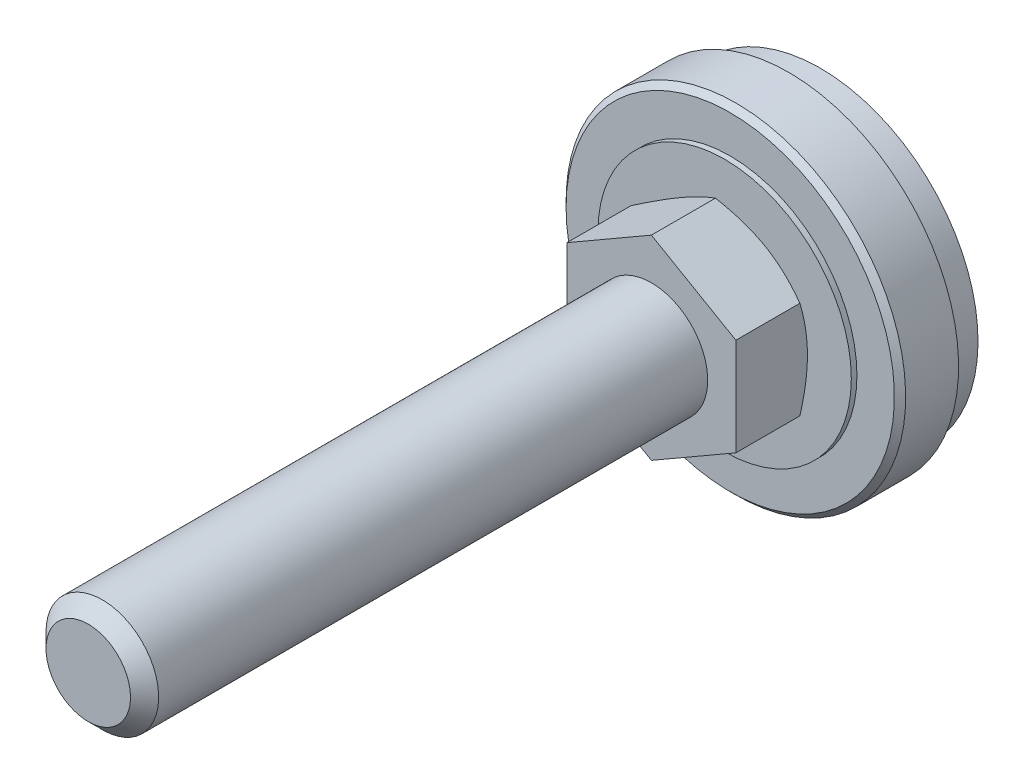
ISO-10303-21;
HEADER;
FILE_DESCRIPTION(('STEP AP214'),'2;1');
FILE_NAME('part.step','',(''),(''),'','','');
FILE_SCHEMA(('AUTOMOTIVE_DESIGN { 1 0 10303 214 1 1 1 1 }'));
ENDSEC;
DATA;
#1=APPLICATION_CONTEXT('core data for automotive mechanical design processes');
#2=APPLICATION_PROTOCOL_DEFINITION('international standard','automotive_design',2000,#1);
#3=PRODUCT_CONTEXT('',#1,'mechanical');
#4=PRODUCT('Part','Part','',(#3));
#5=PRODUCT_RELATED_PRODUCT_CATEGORY('part','',(#4));
#6=PRODUCT_DEFINITION_FORMATION('','',#4);
#7=PRODUCT_DEFINITION_CONTEXT('part definition',#1,'design');
#8=PRODUCT_DEFINITION('design','',#6,#7);
#9=PRODUCT_DEFINITION_SHAPE('','',#8);
#10=(LENGTH_UNIT() NAMED_UNIT(*) SI_UNIT(.MILLI.,.METRE.));
#11=(NAMED_UNIT(*) PLANE_ANGLE_UNIT() SI_UNIT($,.RADIAN.));
#12=(NAMED_UNIT(*) SI_UNIT($,.STERADIAN.) SOLID_ANGLE_UNIT());
#13=UNCERTAINTY_MEASURE_WITH_UNIT(LENGTH_MEASURE(1.E-05),#10,'distance_accuracy_value','');
#14=(GEOMETRIC_REPRESENTATION_CONTEXT(3) GLOBAL_UNCERTAINTY_ASSIGNED_CONTEXT((#13)) GLOBAL_UNIT_ASSIGNED_CONTEXT((#10,
#11,#12)) REPRESENTATION_CONTEXT('',''));
#15=CARTESIAN_POINT('',(0.,0.,0.));
#16=DIRECTION('',(0.,0.,1.));
#17=DIRECTION('',(1.,0.,0.));
#18=AXIS2_PLACEMENT_3D('',#15,#16,#17);
#19=CARTESIAN_POINT('',(0.,0.,30.));
#20=DIRECTION('',(0.,0.,1.));
#21=DIRECTION('',(0.5,-0.866025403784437,0.));
#22=AXIS2_PLACEMENT_3D('',#19,#20,#21);
#23=PLANE('',#22);
#24=DIRECTION('',(0.,1.,0.));
#25=VECTOR('',#24,1.);
#26=CARTESIAN_POINT('',(15.,-8.66025403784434,30.));
#27=LINE('',#26,#25);
#28=CARTESIAN_POINT('',(15.,-8.66025403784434,30.));
#29=VERTEX_POINT('',#28);
#30=CARTESIAN_POINT('',(15.,8.66025403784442,30.));
#31=VERTEX_POINT('',#30);
#32=EDGE_CURVE('E226',#29,#31,#27,.T.);
#33=ORIENTED_EDGE('',*,*,#32,.T.);
#34=DIRECTION('',(-0.86602540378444,0.5,0.));
#35=VECTOR('',#34,1.);
#36=CARTESIAN_POINT('',(15.,8.66025403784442,30.));
#37=LINE('',#36,#35);
#38=CARTESIAN_POINT('',(0.,17.3205080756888,30.));
#39=VERTEX_POINT('',#38);
#40=EDGE_CURVE('E373',#31,#39,#37,.T.);
#41=ORIENTED_EDGE('',*,*,#40,.T.);
#42=DIRECTION('',(-0.866025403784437,-0.5,0.));
#43=VECTOR('',#42,1.);
#44=CARTESIAN_POINT('',(0.,17.3205080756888,30.));
#45=LINE('',#44,#43);
#46=CARTESIAN_POINT('',(-15.,8.66025403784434,30.));
#47=VERTEX_POINT('',#46);
#48=EDGE_CURVE('E372',#39,#47,#45,.T.);
#49=ORIENTED_EDGE('',*,*,#48,.T.);
#50=DIRECTION('',(0.,-1.,0.));
#51=VECTOR('',#50,1.);
#52=CARTESIAN_POINT('',(-15.,8.66025403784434,30.));
#53=LINE('',#52,#51);
#54=CARTESIAN_POINT('',(-15.,-8.66025403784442,30.));
#55=VERTEX_POINT('',#54);
#56=EDGE_CURVE('E377',#47,#55,#53,.T.);
#57=ORIENTED_EDGE('',*,*,#56,.T.);
#58=DIRECTION('',(0.86602540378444,-0.5,0.));
#59=VECTOR('',#58,1.);
#60=CARTESIAN_POINT('',(-15.,-8.66025403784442,30.));
#61=LINE('',#60,#59);
#62=CARTESIAN_POINT('',(0.,-17.3205080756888,30.));
#63=VERTEX_POINT('',#62);
#64=EDGE_CURVE('E379',#55,#63,#61,.T.);
#65=ORIENTED_EDGE('',*,*,#64,.T.);
#66=DIRECTION('',(0.866025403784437,0.5,0.));
#67=VECTOR('',#66,1.);
#68=CARTESIAN_POINT('',(0.,-17.3205080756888,30.));
#69=LINE('',#68,#67);
#70=EDGE_CURVE('E37',#63,#29,#69,.T.);
#71=ORIENTED_EDGE('',*,*,#70,.T.);
#72=EDGE_LOOP('',(#33,#41,#49,#57,#65,#71));
#73=FACE_BOUND('',#72,.T.);
#74=CARTESIAN_POINT('',(0.,0.,30.));
#75=DIRECTION('',(0.,0.,1.));
#76=DIRECTION('',(0.5,-0.866025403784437,0.));
#77=AXIS2_PLACEMENT_3D('',#74,#75,#76);
#78=CIRCLE('',#77,10.);
#79=CARTESIAN_POINT('',(5.,-8.66025403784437,30.));
#80=VERTEX_POINT('',#79);
#81=EDGE_CURVE('E230',#80,#80,#78,.T.);
#82=ORIENTED_EDGE('',*,*,#81,.F.);
#83=EDGE_LOOP('',(#82));
#84=FACE_BOUND('',#83,.T.);
#85=ADVANCED_FACE('F14',(#73,#84),#23,.T.);
#86=CARTESIAN_POINT('',(-11.25,19.4855715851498,17.));
#87=DIRECTION('',(0.,0.,1.));
#88=DIRECTION('',(0.5,-0.866025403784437,0.));
#89=AXIS2_PLACEMENT_3D('',#86,#87,#88);
#90=PLANE('',#89);
#91=CARTESIAN_POINT('',(0.,0.,17.));
#92=DIRECTION('',(0.,0.,1.));
#93=DIRECTION('',(0.5,-0.866025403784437,0.));
#94=AXIS2_PLACEMENT_3D('',#91,#92,#93);
#95=CIRCLE('',#94,22.5);
#96=CARTESIAN_POINT('',(11.25,-19.4855715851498,17.));
#97=VERTEX_POINT('',#96);
#98=EDGE_CURVE('E102',#97,#97,#95,.T.);
#99=ORIENTED_EDGE('',*,*,#98,.T.);
#100=EDGE_LOOP('',(#99));
#101=FACE_BOUND('',#100,.T.);
#102=CARTESIAN_POINT('',(0.,0.,17.));
#103=DIRECTION('',(0.,0.,-1.));
#104=DIRECTION('',(-0.5,0.866025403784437,0.));
#105=AXIS2_PLACEMENT_3D('',#102,#103,#104);
#106=CIRCLE('',#105,14.5);
#107=CARTESIAN_POINT('',(-7.25,12.5573683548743,17.));
#108=VERTEX_POINT('',#107);
#109=EDGE_CURVE('E84',#108,#108,#106,.T.);
#110=ORIENTED_EDGE('',*,*,#109,.T.);
#111=EDGE_LOOP('',(#110));
#112=FACE_BOUND('',#111,.T.);
#113=ADVANCED_FACE('F186',(#101,#112),#90,.T.);
#114=CARTESIAN_POINT('',(0.,0.,0.));
#115=DIRECTION('',(0.,0.,-1.));
#116=DIRECTION('',(-0.5,0.866025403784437,0.));
#117=AXIS2_PLACEMENT_3D('',#114,#115,#116);
#118=PLANE('',#117);
#119=CARTESIAN_POINT('',(0.,0.,0.));
#120=DIRECTION('',(0.,0.,1.));
#121=DIRECTION('',(0.5,-0.866025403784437,0.));
#122=AXIS2_PLACEMENT_3D('',#119,#120,#121);
#123=CIRCLE('',#122,28.);
#124=CARTESIAN_POINT('',(14.,-24.2487113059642,0.));
#125=VERTEX_POINT('',#124);
#126=EDGE_CURVE('E73',#125,#125,#123,.T.);
#127=ORIENTED_EDGE('',*,*,#126,.F.);
#128=EDGE_LOOP('',(#127));
#129=FACE_BOUND('',#128,.T.);
#130=ADVANCED_FACE('F189',(#129),#118,.T.);
#131=CARTESIAN_POINT('',(0.,0.,134.742297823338));
#132=DIRECTION('',(0.,0.,1.));
#133=DIRECTION('',(0.5,-0.866025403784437,0.));
#134=AXIS2_PLACEMENT_3D('',#131,#132,#133);
#135=CYLINDRICAL_SURFACE('',#134,28.);
#136=ORIENTED_EDGE('',*,*,#126,.T.);
#137=EDGE_LOOP('',(#136));
#138=FACE_BOUND('',#137,.T.);
#139=CARTESIAN_POINT('',(0.,0.,5.6));
#140=DIRECTION('',(0.,0.,1.));
#141=DIRECTION('',(0.5,-0.866025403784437,0.));
#142=AXIS2_PLACEMENT_3D('',#139,#140,#141);
#143=CIRCLE('',#142,28.);
#144=CARTESIAN_POINT('',(14.,-24.2487113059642,5.6));
#145=VERTEX_POINT('',#144);
#146=EDGE_CURVE('E117',#145,#145,#143,.T.);
#147=ORIENTED_EDGE('',*,*,#146,.F.);
#148=EDGE_LOOP('',(#147));
#149=FACE_BOUND('',#148,.T.);
#150=ADVANCED_FACE('F209',(#138,#149),#135,.T.);
#151=CARTESIAN_POINT('',(-15.075,26.1106659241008,5.6));
#152=DIRECTION('',(0.,0.,-1.));
#153=DIRECTION('',(-0.5,0.866025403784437,0.));
#154=AXIS2_PLACEMENT_3D('',#151,#152,#153);
#155=PLANE('',#154);
#156=ORIENTED_EDGE('',*,*,#146,.T.);
#157=EDGE_LOOP('',(#156));
#158=FACE_BOUND('',#157,.T.);
#159=CARTESIAN_POINT('',(0.,0.,5.6));
#160=DIRECTION('',(0.,0.,1.));
#161=DIRECTION('',(0.5,-0.866025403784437,0.));
#162=AXIS2_PLACEMENT_3D('',#159,#160,#161);
#163=CIRCLE('',#162,30.15);
#164=CARTESIAN_POINT('',(15.075,-26.1106659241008,5.6));
#165=VERTEX_POINT('',#164);
#166=EDGE_CURVE('E114',#165,#165,#163,.T.);
#167=ORIENTED_EDGE('',*,*,#166,.F.);
#168=EDGE_LOOP('',(#167));
#169=FACE_BOUND('',#168,.T.);
#170=ADVANCED_FACE('F205',(#158,#169),#155,.T.);
#171=CARTESIAN_POINT('',(0.,0.,134.742297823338));
#172=DIRECTION('',(0.,0.,1.));
#173=DIRECTION('',(0.5,-0.866025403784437,0.));
#174=AXIS2_PLACEMENT_3D('',#171,#172,#173);
#175=CYLINDRICAL_SURFACE('',#174,30.15);
#176=ORIENTED_EDGE('',*,*,#166,.T.);
#177=EDGE_LOOP('',(#176));
#178=FACE_BOUND('',#177,.T.);
#179=CARTESIAN_POINT('',(0.,0.,15.));
#180=DIRECTION('',(0.,0.,1.));
#181=DIRECTION('',(0.5,-0.866025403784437,0.));
#182=AXIS2_PLACEMENT_3D('',#179,#180,#181);
#183=CIRCLE('',#182,30.15);
#184=CARTESIAN_POINT('',(15.075,-26.1106659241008,15.));
#185=VERTEX_POINT('',#184);
#186=EDGE_CURVE('E111',#185,#185,#183,.T.);
#187=ORIENTED_EDGE('',*,*,#186,.F.);
#188=EDGE_LOOP('',(#187));
#189=FACE_BOUND('',#188,.T.);
#190=ADVANCED_FACE('F201',(#178,#189),#175,.T.);
#191=CARTESIAN_POINT('',(0.,0.,16.));
#192=DIRECTION('',(0.,0.,-1.));
#193=DIRECTION('',(-0.5,0.866025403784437,0.));
#194=AXIS2_PLACEMENT_3D('',#191,#192,#193);
#195=CONICAL_SURFACE('',#194,29.15,0.785398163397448);
#196=ORIENTED_EDGE('',*,*,#186,.T.);
#197=EDGE_LOOP('',(#196));
#198=FACE_BOUND('',#197,.T.);
#199=CARTESIAN_POINT('',(0.,0.,16.));
#200=DIRECTION('',(0.,0.,1.));
#201=DIRECTION('',(0.5,-0.866025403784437,0.));
#202=AXIS2_PLACEMENT_3D('',#199,#200,#201);
#203=CIRCLE('',#202,29.15);
#204=CARTESIAN_POINT('',(14.575,-25.2446405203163,16.));
#205=VERTEX_POINT('',#204);
#206=EDGE_CURVE('E108',#205,#205,#203,.T.);
#207=ORIENTED_EDGE('',*,*,#206,.F.);
#208=EDGE_LOOP('',(#207));
#209=FACE_BOUND('',#208,.T.);
#210=ADVANCED_FACE('F197',(#198,#209),#195,.T.);
#211=CARTESIAN_POINT('',(-14.575,25.2446405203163,16.));
#212=DIRECTION('',(0.,0.,1.));
#213=DIRECTION('',(0.5,-0.866025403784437,0.));
#214=AXIS2_PLACEMENT_3D('',#211,#212,#213);
#215=PLANE('',#214);
#216=ORIENTED_EDGE('',*,*,#206,.T.);
#217=EDGE_LOOP('',(#216));
#218=FACE_BOUND('',#217,.T.);
#219=CARTESIAN_POINT('',(0.,0.,16.));
#220=DIRECTION('',(0.,0.,1.));
#221=DIRECTION('',(0.5,-0.866025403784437,0.));
#222=AXIS2_PLACEMENT_3D('',#219,#220,#221);
#223=CIRCLE('',#222,22.5);
#224=CARTESIAN_POINT('',(11.25,-19.4855715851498,16.));
#225=VERTEX_POINT('',#224);
#226=EDGE_CURVE('E105',#225,#225,#223,.T.);
#227=ORIENTED_EDGE('',*,*,#226,.F.);
#228=EDGE_LOOP('',(#227));
#229=FACE_BOUND('',#228,.T.);
#230=ADVANCED_FACE('F193',(#218,#229),#215,.T.);
#231=CARTESIAN_POINT('',(0.,0.,134.742297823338));
#232=DIRECTION('',(0.,0.,1.));
#233=DIRECTION('',(0.5,-0.866025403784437,0.));
#234=AXIS2_PLACEMENT_3D('',#231,#232,#233);
#235=CYLINDRICAL_SURFACE('',#234,22.5);
#236=ORIENTED_EDGE('',*,*,#226,.T.);
#237=EDGE_LOOP('',(#236));
#238=FACE_BOUND('',#237,.T.);
#239=ORIENTED_EDGE('',*,*,#98,.F.);
#240=EDGE_LOOP('',(#239));
#241=FACE_BOUND('',#240,.T.);
#242=ADVANCED_FACE('F133',(#238,#241),#235,.T.);
#243=CARTESIAN_POINT('',(0.,0.,22.4252428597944));
#244=DIRECTION('',(0.,0.,1.));
#245=DIRECTION('',(0.5,-0.866025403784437,0.));
#246=AXIS2_PLACEMENT_3D('',#243,#244,#245);
#247=CONICAL_SURFACE('',#246,23.8967962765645,1.0471975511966);
#248=ORIENTED_EDGE('',*,*,#109,.F.);
#249=EDGE_LOOP('',(#248));
#250=FACE_BOUND('',#249,.T.);
#251=CARTESIAN_POINT('',(-12.8156002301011,-24.7195983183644,24.7042637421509));
#252=CARTESIAN_POINT('',(-12.531199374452,-24.5553994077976,24.5445303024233));
#253=CARTESIAN_POINT('',(-12.2464693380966,-24.3910104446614,24.3855786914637));
#254=CARTESIAN_POINT('',(-11.6762822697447,-24.0618127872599,24.0694158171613));
#255=CARTESIAN_POINT('',(-11.3908252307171,-23.8970040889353,23.9122045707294));
#256=CARTESIAN_POINT('',(-10.5331869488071,-23.4018463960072,23.443406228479));
#257=CARTESIAN_POINT('',(-9.95982008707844,-23.0708128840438,23.1347004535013));
#258=CARTESIAN_POINT('',(-8.80626593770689,-22.4048080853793,22.5251819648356));
#259=CARTESIAN_POINT('',(-8.22605861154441,-22.0698252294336,22.2244196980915));
#260=CARTESIAN_POINT('',(-7.06108881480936,-21.3972296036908,21.6349394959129));
#261=CARTESIAN_POINT('',(-6.47632655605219,-21.0596169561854,21.3462210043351));
#262=CARTESIAN_POINT('',(-5.28180185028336,-20.3699577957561,20.7746714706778));
#263=CARTESIAN_POINT('',(-4.67185404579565,-20.0178042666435,20.49235431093));
#264=CARTESIAN_POINT('',(-3.44488115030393,-19.309411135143,19.9486150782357));
#265=CARTESIAN_POINT('',(-2.82785528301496,-18.9531710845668,19.6871953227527));
#266=CARTESIAN_POINT('',(-1.58686537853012,-18.2366852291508,19.1919746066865));
#267=CARTESIAN_POINT('',(-0.96291770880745,-17.8764488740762,18.9581193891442));
#268=CARTESIAN_POINT('',(0.293985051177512,-17.1507757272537,18.5253878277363));
#269=CARTESIAN_POINT('',(0.926937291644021,-16.7853405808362,18.3265006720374));
#270=CARTESIAN_POINT('',(1.88148437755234,-16.2342325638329,18.0620414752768));
#271=CARTESIAN_POINT('',(2.19961844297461,-16.0505577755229,17.9797180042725));
#272=CARTESIAN_POINT('',(2.83809132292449,-15.6819352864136,17.8273230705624));
#273=CARTESIAN_POINT('',(3.15843009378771,-15.4969876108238,17.757251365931));
#274=CARTESIAN_POINT('',(3.80110433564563,-15.1259394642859,17.6305843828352));
#275=CARTESIAN_POINT('',(4.12343977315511,-14.9398390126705,17.5739888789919));
#276=CARTESIAN_POINT('',(4.76977798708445,-14.5666754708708,17.4753959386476));
#277=CARTESIAN_POINT('',(5.09378068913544,-14.3796124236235,17.4333978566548));
#278=CARTESIAN_POINT('',(5.73869803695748,-14.0072692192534,17.3653714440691));
#279=CARTESIAN_POINT('',(6.05959634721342,-13.8219984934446,17.3391378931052));
#280=CARTESIAN_POINT('',(6.70206615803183,-13.4510683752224,17.3023738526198));
#281=CARTESIAN_POINT('',(7.02363764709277,-13.2654089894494,17.2918430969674));
#282=CARTESIAN_POINT('',(7.66687876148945,-12.8940335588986,17.2867359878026));
#283=CARTESIAN_POINT('',(7.98854838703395,-12.7083175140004,17.2921596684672));
#284=CARTESIAN_POINT('',(8.63139929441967,-12.3371673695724,17.3188268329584));
#285=CARTESIAN_POINT('',(8.95258055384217,-12.1517332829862,17.3400710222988));
#286=CARTESIAN_POINT('',(9.71937227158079,-11.7090258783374,17.4092190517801));
#287=CARTESIAN_POINT('',(10.1645061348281,-11.4520277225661,17.4643010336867));
#288=CARTESIAN_POINT('',(11.0515840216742,-10.9398730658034,17.6018992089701));
#289=CARTESIAN_POINT('',(11.4935276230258,-10.6847168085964,17.6844189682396));
#290=CARTESIAN_POINT('',(12.3737638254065,-10.1765122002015,17.8739575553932));
#291=CARTESIAN_POINT('',(12.8120534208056,-9.92346558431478,17.9809948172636));
#292=CARTESIAN_POINT('',(13.6842925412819,-9.41987809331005,18.2162917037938));
#293=CARTESIAN_POINT('',(14.1182421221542,-9.16933718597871,18.3445510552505));
#294=CARTESIAN_POINT('',(14.9915095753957,-8.66515598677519,18.6222437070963));
#295=CARTESIAN_POINT('',(15.4307286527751,-8.41157273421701,18.7720883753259));
#296=CARTESIAN_POINT('',(16.3048424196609,-7.90690291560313,19.0876591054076));
#297=CARTESIAN_POINT('',(16.7397370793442,-7.65581636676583,19.253385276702));
#298=CARTESIAN_POINT('',(17.605411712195,-7.15601888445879,19.5980527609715));
#299=CARTESIAN_POINT('',(18.0361929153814,-6.90730724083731,19.7769899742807));
#300=CARTESIAN_POINT('',(18.8941620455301,-6.41195853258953,20.1459352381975));
#301=CARTESIAN_POINT('',(19.3213500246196,-6.16532143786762,20.335943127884));
#302=CARTESIAN_POINT('',(20.3671937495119,-5.56150328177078,20.8142166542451));
#303=CARTESIAN_POINT('',(20.9840653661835,-5.20535228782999,21.1076776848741));
#304=CARTESIAN_POINT('',(22.21222970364,-4.49627127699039,21.7098205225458));
#305=CARTESIAN_POINT('',(22.8235220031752,-4.14334150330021,22.0185034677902));
#306=CARTESIAN_POINT('',(24.041630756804,-3.44006608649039,22.64789067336));
#307=CARTESIAN_POINT('',(24.6484459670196,-3.08972116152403,22.9685981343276));
#308=CARTESIAN_POINT('',(25.8582248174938,-2.39125501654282,23.6194839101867));
#309=CARTESIAN_POINT('',(26.4611885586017,-2.0431337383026,23.9496619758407));
#310=CARTESIAN_POINT('',(27.6646871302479,-1.34829351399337,24.6180526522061));
#311=CARTESIAN_POINT('',(28.2652179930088,-1.00157685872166,24.9562747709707));
#312=CARTESIAN_POINT('',(29.4636269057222,-0.309675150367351,25.6389282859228));
#313=CARTESIAN_POINT('',(30.0615049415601,0.0355098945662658,25.9833597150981));
#314=CARTESIAN_POINT('',(31.2549440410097,0.724542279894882,26.6772703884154));
#315=CARTESIAN_POINT('',(31.8505054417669,1.06838981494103,27.0267488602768));
#316=CARTESIAN_POINT('',(33.0397454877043,1.75499787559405,27.729943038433));
#317=CARTESIAN_POINT('',(33.633424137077,2.0977584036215,28.0836587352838));
#318=CARTESIAN_POINT('',(35.3053941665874,3.06307075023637,29.0861455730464));
#319=CARTESIAN_POINT('',(36.3818468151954,3.68456097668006,29.7390052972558));
#320=CARTESIAN_POINT('',(38.5308195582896,4.92527096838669,31.0534039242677));
#321=CARTESIAN_POINT('',(39.6033394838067,5.54449063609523,31.7149431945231));
#322=CARTESIAN_POINT('',(41.7423385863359,6.77944234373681,33.0427714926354));
#323=CARTESIAN_POINT('',(42.8088262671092,7.3951792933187,33.7090422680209));
#324=CARTESIAN_POINT('',(44.4067215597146,8.31772457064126,34.7122533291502));
#325=CARTESIAN_POINT('',(44.9390311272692,8.62505364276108,35.0472809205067));
#326=CARTESIAN_POINT('',(46.0031101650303,9.23939996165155,35.7184756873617));
#327=CARTESIAN_POINT('',(46.5348796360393,9.54641720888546,36.054642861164));
#328=CARTESIAN_POINT('',(47.0664104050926,9.85329664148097,36.3913126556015));
#329=B_SPLINE_CURVE_WITH_KNOTS('',3,(#251,#252,#253,#254,#255,#256,#257,#258,#259,#260,#261,
#262,#263,#264,#265,#266,#267,#268,#269,#270,#271,#272,#273,#274,#275,#276,#277,#278,#279,#280,
#281,#282,#283,#284,#285,#286,#287,#288,#289,#290,#291,#292,#293,#294,#295,#296,#297,#298,#299,
#300,#301,#302,#303,#304,#305,#306,#307,#308,#309,#310,#311,#312,#313,#314,#315,#316,#317,#318,
#319,#320,#321,#322,#323,#324,#325,#326,#327,#328),.UNSPECIFIED.,.F.,.F.,(4,2,2,2,2,2,2,2,2,2,2,
2,2,2,2,2,2,2,2,2,2,2,2,2,2,2,2,2,2,2,2,2,2,2,2,2,2,2,4),(0.,1.0955523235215,2.19111528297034,
4.38255547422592,6.58559894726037,8.78854057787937,11.0646358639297,13.340983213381,
15.612772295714,17.8838577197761,19.0130694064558,20.1422587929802,21.2714292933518,
22.400549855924,23.5146339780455,24.6286992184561,25.7427668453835,26.8568841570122,
28.4068489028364,29.9570151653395,31.5083508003,33.059666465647,34.645875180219,
36.2320948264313,37.817824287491,39.4035307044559,41.7144394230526,44.0255212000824,
46.3372225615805,48.6488631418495,50.9633871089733,53.2779233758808,55.5921091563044,
57.9062897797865,62.1182482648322,66.330385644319,70.5308455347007,72.6309477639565,
74.7310468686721),.UNSPECIFIED.);
#330=CARTESIAN_POINT('',(0.,-17.3205080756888,18.6284210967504));
#331=VERTEX_POINT('',#330);
#332=CARTESIAN_POINT('',(15.,-8.66025403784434,18.6284210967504));
#333=VERTEX_POINT('',#332);
#334=EDGE_CURVE('E65',#331,#333,#329,.T.);
#335=ORIENTED_EDGE('',*,*,#334,.F.);
#336=CARTESIAN_POINT('',(-15.0002,-8.66013856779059,18.6284877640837));
#337=CARTESIAN_POINT('',(-14.6705058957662,-8.8504875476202,18.5185969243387));
#338=CARTESIAN_POINT('',(-14.3395258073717,-9.04157899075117,18.4136927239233));
#339=CARTESIAN_POINT('',(-13.674911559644,-9.42529420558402,18.2152437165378));
#340=CARTESIAN_POINT('',(-13.3412765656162,-9.61791845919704,18.1217026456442));
#341=CARTESIAN_POINT('',(-12.6707077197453,-10.0050715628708,17.9472372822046));
#342=CARTESIAN_POINT('',(-12.333767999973,-10.199603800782,17.8663428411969));
#343=CARTESIAN_POINT('',(-11.6575472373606,-10.5900200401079,17.7189077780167));
#344=CARTESIAN_POINT('',(-11.3182663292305,-10.7859039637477,17.652366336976));
#345=CARTESIAN_POINT('',(-10.6460568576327,-11.1740042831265,17.536467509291));
#346=CARTESIAN_POINT('',(-10.3131781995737,-11.3661918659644,17.4867265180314));
#347=CARTESIAN_POINT('',(-9.64589556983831,-11.7514476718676,17.4033218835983));
#348=CARTESIAN_POINT('',(-9.31149156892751,-11.9445159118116,17.3696585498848));
#349=CARTESIAN_POINT('',(-8.64212181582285,-12.3309767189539,17.3192592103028));
#350=CARTESIAN_POINT('',(-8.30715720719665,-12.5243686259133,17.3025030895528));
#351=CARTESIAN_POINT('',(-7.63691878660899,-12.9113309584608,17.2862785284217));
#352=CARTESIAN_POINT('',(-7.30164498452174,-13.1049013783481,17.2868095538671));
#353=CARTESIAN_POINT('',(-6.67485311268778,-13.4667798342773,17.3039517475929));
#354=CARTESIAN_POINT('',(-6.38329037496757,-13.6351136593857,17.3184719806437));
#355=CARTESIAN_POINT('',(-5.80083556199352,-13.9713941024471,17.3603122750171));
#356=CARTESIAN_POINT('',(-5.50994353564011,-14.1393406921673,17.3876332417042));
#357=CARTESIAN_POINT('',(-4.92898814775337,-14.4747554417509,17.4545986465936));
#358=CARTESIAN_POINT('',(-4.63892567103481,-14.6422230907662,17.4942532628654));
#359=CARTESIAN_POINT('',(-4.06016058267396,-14.9763732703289,17.5851902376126));
#360=CARTESIAN_POINT('',(-3.77145806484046,-15.1430557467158,17.636473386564));
#361=CARTESIAN_POINT('',(-2.89508556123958,-15.6490296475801,17.8090619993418));
#362=CARTESIAN_POINT('',(-2.30995340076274,-15.9868558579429,17.9475763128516));
#363=CARTESIAN_POINT('',(-1.14841408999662,-16.6574708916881,18.2619471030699));
#364=CARTESIAN_POINT('',(-0.571992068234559,-16.9902683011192,18.4377297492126));
#365=CARTESIAN_POINT('',(0.000200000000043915,-17.3206235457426,18.6284877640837));
#366=B_SPLINE_CURVE_WITH_KNOTS('',3,(#336,#337,#338,#339,#340,#341,#342,#343,#344,#345,#346,
#347,#348,#349,#350,#351,#352,#353,#354,#355,#356,#357,#358,#359,#360,#361,#362,#363,#364,#365),
.UNSPECIFIED.,.F.,.F.,(4,2,2,2,2,2,2,2,2,2,2,2,2,2,4),(0.,1.18875411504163,2.37789802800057,
3.56980778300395,4.76164951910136,5.92407379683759,7.08652044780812,8.24758247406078,
9.40860862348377,10.4193068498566,11.4300765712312,12.4416826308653,13.4533574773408,
15.5211962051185,17.5849760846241),.UNSPECIFIED.);
#367=CARTESIAN_POINT('',(-15.,-8.66025403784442,18.6284210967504));
#368=VERTEX_POINT('',#367);
#369=EDGE_CURVE('E68',#368,#331,#366,.T.);
#370=ORIENTED_EDGE('',*,*,#369,.F.);
#371=CARTESIAN_POINT('',(-15.,8.66048497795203,18.6284877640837));
#372=CARTESIAN_POINT('',(-15.,8.27978701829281,18.5185969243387));
#373=CARTESIAN_POINT('',(-15.,7.89760413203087,18.4136927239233));
#374=CARTESIAN_POINT('',(-15.,7.13017370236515,18.2152437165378));
#375=CARTESIAN_POINT('',(-15.,6.74492519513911,18.1217026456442));
#376=CARTESIAN_POINT('',(-15.,5.9706189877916,17.9472372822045));
#377=CARTESIAN_POINT('',(-15.,5.58155451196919,17.8663428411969));
#378=CARTESIAN_POINT('',(-15.,4.80072203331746,17.7189077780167));
#379=CARTESIAN_POINT('',(-15.,4.4089541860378,17.652366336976));
#380=CARTESIAN_POINT('',(-15.,3.63275354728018,17.536467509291));
#381=CARTESIAN_POINT('',(-15.,3.24837838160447,17.4867265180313));
#382=CARTESIAN_POINT('',(-15.,2.47786676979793,17.4033218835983));
#383=CARTESIAN_POINT('',(-15.,2.09173028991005,17.3696585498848));
#384=CARTESIAN_POINT('',(-15.,1.31880867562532,17.3192592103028));
#385=CARTESIAN_POINT('',(-15.,0.932024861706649,17.3025030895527));
#386=CARTESIAN_POINT('',(-15.,0.158100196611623,17.2862785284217));
#387=CARTESIAN_POINT('',(-15.,-0.229040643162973,17.2868095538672));
#388=CARTESIAN_POINT('',(-15.,-0.952797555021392,17.3039517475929));
#389=CARTESIAN_POINT('',(-15.,-1.28946520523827,17.3184719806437));
#390=CARTESIAN_POINT('',(-15.,-1.962026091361,17.3603122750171));
#391=CARTESIAN_POINT('',(-15.,-2.29791927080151,17.3876332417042));
#392=CARTESIAN_POINT('',(-15.,-2.96874876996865,17.4545986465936));
#393=CARTESIAN_POINT('',(-15.,-3.30368406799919,17.4942532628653));
#394=CARTESIAN_POINT('',(-15.,-3.97198442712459,17.5851902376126));
#395=CARTESIAN_POINT('',(-15.,-4.30534937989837,17.6364733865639));
#396=CARTESIAN_POINT('',(-15.,-5.31729718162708,17.8090619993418));
#397=CARTESIAN_POINT('',(-15.,-5.99294960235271,17.9475763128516));
#398=CARTESIAN_POINT('',(-15.,-7.334179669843,18.2619471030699));
#399=CARTESIAN_POINT('',(-15.,-7.9997744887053,18.4377297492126));
#400=CARTESIAN_POINT('',(-15.,-8.6604849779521,18.6284877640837));
#401=B_SPLINE_CURVE_WITH_KNOTS('',3,(#371,#372,#373,#374,#375,#376,#377,#378,#379,#380,#381,
#382,#383,#384,#385,#386,#387,#388,#389,#390,#391,#392,#393,#394,#395,#396,#397,#398,#399,#400),
.UNSPECIFIED.,.F.,.F.,(4,2,2,2,2,2,2,2,2,2,2,2,2,2,4),(0.,1.18875411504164,2.37789802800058,
3.56980778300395,4.76164951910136,5.92407379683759,7.08652044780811,8.24758247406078,
9.40860862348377,10.4193068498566,11.4300765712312,12.4416826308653,13.4533574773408,
15.5211962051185,17.5849760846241),.UNSPECIFIED.);
#402=CARTESIAN_POINT('',(-15.,8.66025403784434,18.6284210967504));
#403=VERTEX_POINT('',#402);
#404=EDGE_CURVE('E83',#403,#368,#401,.T.);
#405=ORIENTED_EDGE('',*,*,#404,.F.);
#406=CARTESIAN_POINT('',(-27.8156002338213,1.26116379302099,24.7042637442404));
#407=CARTESIAN_POINT('',(-27.5311993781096,1.42536270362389,24.5445303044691));
#408=CARTESIAN_POINT('',(-27.2464693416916,1.5897516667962,24.3855786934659));
#409=CARTESIAN_POINT('',(-26.6762822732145,1.91894932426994,24.0694158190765));
#410=CARTESIAN_POINT('',(-26.3908252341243,2.08375802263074,23.912204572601));
#411=CARTESIAN_POINT('',(-25.5331869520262,2.57891571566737,23.4434062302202));
#412=CARTESIAN_POINT('',(-24.959820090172,2.9099492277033,23.1347004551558));
#413=CARTESIAN_POINT('',(-23.8062659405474,3.57595402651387,22.5251819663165));
#414=CARTESIAN_POINT('',(-23.2260586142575,3.91093688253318,22.2244196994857));
#415=CARTESIAN_POINT('',(-22.0610888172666,4.58353250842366,21.6349394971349));
#416=CARTESIAN_POINT('',(-21.476326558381,4.92114515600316,21.3462210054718));
#417=CARTESIAN_POINT('',(-20.2818018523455,5.61080431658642,20.7746714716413));
#418=CARTESIAN_POINT('',(-19.6718540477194,5.96295784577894,20.4923543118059));
#419=CARTESIAN_POINT('',(-18.4448811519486,6.67135097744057,19.9486150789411));
#420=CARTESIAN_POINT('',(-17.827855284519,7.02759102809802,19.6871953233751));
#421=CARTESIAN_POINT('',(-16.5868653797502,7.74407688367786,19.1919746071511));
#422=CARTESIAN_POINT('',(-15.9629177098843,8.10431323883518,18.9581193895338));
#423=CARTESIAN_POINT('',(-14.706014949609,8.82998638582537,18.5253878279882));
#424=CARTESIAN_POINT('',(-14.0730627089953,9.19542153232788,18.3265006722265));
#425=CARTESIAN_POINT('',(-13.1185156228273,9.74652954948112,18.062041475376));
#426=CARTESIAN_POINT('',(-12.800381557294,9.93020433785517,17.9797180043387));
#427=CARTESIAN_POINT('',(-12.1619086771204,10.2988268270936,17.8273230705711));
#428=CARTESIAN_POINT('',(-11.8415699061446,10.4837745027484,17.757251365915));
#429=CARTESIAN_POINT('',(-11.1988956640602,10.8548226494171,17.6305843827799));
#430=CARTESIAN_POINT('',(-10.8765602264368,11.0409231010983,17.5739888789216));
#431=CARTESIAN_POINT('',(-10.2302220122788,11.41408664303,17.4753959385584));
#432=CARTESIAN_POINT('',(-9.906219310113,11.6011496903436,17.4333978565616));
#433=CARTESIAN_POINT('',(-9.26130196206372,11.9734928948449,17.3653714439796));
#434=CARTESIAN_POINT('',(-8.94040365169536,12.1587636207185,17.3391378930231));
#435=CARTESIAN_POINT('',(-8.29793384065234,12.5296937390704,17.3023738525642));
#436=CARTESIAN_POINT('',(-7.97636235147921,12.7153531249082,17.2918430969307));
#437=CARTESIAN_POINT('',(-7.33312123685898,13.0867285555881,17.2867359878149));
#438=CARTESIAN_POINT('',(-7.01145161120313,13.2724446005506,17.2921596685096));
#439=CARTESIAN_POINT('',(-6.36860070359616,13.6435947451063,17.3188268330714));
#440=CARTESIAN_POINT('',(-6.04741944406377,13.829028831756,17.3400710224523));
#441=CARTESIAN_POINT('',(-5.28062772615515,14.2717362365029,17.4092190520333));
#442=CARTESIAN_POINT('',(-4.8354938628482,14.5287343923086,17.4643010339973));
#443=CARTESIAN_POINT('',(-3.94841597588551,15.0408890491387,17.6018992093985));
#444=CARTESIAN_POINT('',(-3.50647237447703,15.2960453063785,17.6844189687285));
#445=CARTESIAN_POINT('',(-2.62623617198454,15.804249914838,17.8739575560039));
#446=CARTESIAN_POINT('',(-2.18794657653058,16.0572965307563,17.9809948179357));
#447=CARTESIAN_POINT('',(-1.31570745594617,16.5608840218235,18.2162917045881));
#448=CARTESIAN_POINT('',(-0.88175787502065,16.8114249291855,18.3445510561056));
#449=CARTESIAN_POINT('',(-0.00849042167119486,17.3156061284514,18.6222437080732));
#450=CARTESIAN_POINT('',(0.430728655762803,17.5691893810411,18.772088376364));
#451=CARTESIAN_POINT('',(1.30484242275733,18.0738591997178,19.087659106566));
#452=CARTESIAN_POINT('',(1.73973708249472,18.3249457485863,19.2533852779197));
#453=CARTESIAN_POINT('',(2.60541171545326,18.8247432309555,19.5980527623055));
#454=CARTESIAN_POINT('',(3.03619291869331,19.073454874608,19.7769899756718));
#455=CARTESIAN_POINT('',(3.89416204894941,19.5688035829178,20.145935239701));
#456=CARTESIAN_POINT('',(4.32135002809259,19.8154406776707,20.3359431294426));
#457=CARTESIAN_POINT('',(5.36719375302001,20.4192588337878,20.8142166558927));
#458=CARTESIAN_POINT('',(5.98406536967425,20.7754098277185,21.1076776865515));
#459=CARTESIAN_POINT('',(7.21222970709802,21.4844908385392,21.7098205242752));
#460=CARTESIAN_POINT('',(7.82352200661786,21.8374206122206,22.018503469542));
#461=CARTESIAN_POINT('',(9.04163076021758,22.5406960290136,22.6478906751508));
#462=CARTESIAN_POINT('',(9.64844597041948,22.891040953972,22.9685981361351));
#463=CARTESIAN_POINT('',(10.8582248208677,23.5895070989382,23.6194839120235));
#464=CARTESIAN_POINT('',(11.4611885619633,23.9376283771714,23.9496619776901));
#465=CARTESIAN_POINT('',(12.6646871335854,24.6324686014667,24.6180526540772));
#466=CARTESIAN_POINT('',(13.2652179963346,24.9791852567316,24.9562747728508));
#467=CARTESIAN_POINT('',(14.4636269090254,25.6710869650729,25.6389282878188));
#468=CARTESIAN_POINT('',(15.0615049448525,26.0162720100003,25.9833597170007));
#469=CARTESIAN_POINT('',(16.2549440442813,26.7053043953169,26.6772703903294));
#470=CARTESIAN_POINT('',(16.8505054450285,27.0491519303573,27.0267488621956));
#471=CARTESIAN_POINT('',(18.0397454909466,27.7357599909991,27.72994304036));
#472=CARTESIAN_POINT('',(18.6334241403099,28.0785205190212,28.0836587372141));
#473=CARTESIAN_POINT('',(20.3053941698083,29.0438328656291,29.0861455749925));
#474=CARTESIAN_POINT('',(21.381846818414,29.6653230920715,29.7390052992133));
#475=CARTESIAN_POINT('',(23.5308195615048,30.9060330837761,31.0534039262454));
#476=CARTESIAN_POINT('',(24.6033394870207,31.525252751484,31.7149431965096));
#477=CARTESIAN_POINT('',(26.7423385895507,32.760204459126,33.0427714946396));
#478=CARTESIAN_POINT('',(27.808826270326,33.375941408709,33.7090422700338));
#479=CARTESIAN_POINT('',(29.4067215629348,34.2984866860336,34.7122533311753));
#480=CARTESIAN_POINT('',(29.9390311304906,34.6058157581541,35.0472809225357));
#481=CARTESIAN_POINT('',(31.0031101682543,35.2201620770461,35.7184756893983));
#482=CARTESIAN_POINT('',(31.5348796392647,35.5271793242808,36.0546428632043));
#483=CARTESIAN_POINT('',(32.0664104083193,35.8340587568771,36.3913126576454));
#484=B_SPLINE_CURVE_WITH_KNOTS('',3,(#406,#407,#408,#409,#410,#411,#412,#413,#414,#415,#416,
#417,#418,#419,#420,#421,#422,#423,#424,#425,#426,#427,#428,#429,#430,#431,#432,#433,#434,#435,
#436,#437,#438,#439,#440,#441,#442,#443,#444,#445,#446,#447,#448,#449,#450,#451,#452,#453,#454,
#455,#456,#457,#458,#459,#460,#461,#462,#463,#464,#465,#466,#467,#468,#469,#470,#471,#472,#473,
#474,#475,#476,#477,#478,#479,#480,#481,#482,#483),.UNSPECIFIED.,.F.,.F.,(4,2,2,2,2,2,2,2,2,2,2,
2,2,2,2,2,2,2,2,2,2,2,2,2,2,2,2,2,2,2,2,2,2,2,2,2,2,2,4),(0.,1.09555232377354,2.19111528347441,
4.38255547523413,6.58559894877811,8.78854057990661,11.0646358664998,13.3409832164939,
15.6127722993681,17.8838577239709,19.0130694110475,20.1422587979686,21.2714292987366,
22.4005498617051,23.5146339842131,24.6286992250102,25.7427668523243,26.8568841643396,
28.4068489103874,29.9570151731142,31.5083508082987,33.0596664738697,34.6458751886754,
36.2320948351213,37.817824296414,39.403530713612,41.7144394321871,44.0255212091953,
46.3372225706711,48.6488631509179,50.9633871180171,53.2779233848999,55.5921091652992,
57.906289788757,62.1182482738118,66.3303856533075,70.5308455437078,72.6309477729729,
74.7310468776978),.UNSPECIFIED.);
#485=CARTESIAN_POINT('',(0.,17.3205080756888,18.6284210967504));
#486=VERTEX_POINT('',#485);
#487=EDGE_CURVE('E155',#486,#403,#484,.F.);
#488=ORIENTED_EDGE('',*,*,#487,.F.);
#489=CARTESIAN_POINT('',(15.0002,8.66013856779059,18.6284877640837));
#490=CARTESIAN_POINT('',(14.6705058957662,8.8504875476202,18.5185969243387));
#491=CARTESIAN_POINT('',(14.3395258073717,9.04157899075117,18.4136927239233));
#492=CARTESIAN_POINT('',(13.674911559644,9.42529420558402,18.2152437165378));
#493=CARTESIAN_POINT('',(13.3412765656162,9.61791845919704,18.1217026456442));
#494=CARTESIAN_POINT('',(12.6707077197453,10.0050715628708,17.9472372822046));
#495=CARTESIAN_POINT('',(12.333767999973,10.199603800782,17.8663428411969));
#496=CARTESIAN_POINT('',(11.6575472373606,10.5900200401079,17.7189077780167));
#497=CARTESIAN_POINT('',(11.3182663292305,10.7859039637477,17.652366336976));
#498=CARTESIAN_POINT('',(10.6460568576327,11.1740042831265,17.536467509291));
#499=CARTESIAN_POINT('',(10.3131781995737,11.3661918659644,17.4867265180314));
#500=CARTESIAN_POINT('',(9.64589556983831,11.7514476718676,17.4033218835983));
#501=CARTESIAN_POINT('',(9.31149156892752,11.9445159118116,17.3696585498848));
#502=CARTESIAN_POINT('',(8.64212181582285,12.3309767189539,17.3192592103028));
#503=CARTESIAN_POINT('',(8.30715720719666,12.5243686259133,17.3025030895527));
#504=CARTESIAN_POINT('',(7.636918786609,12.9113309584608,17.2862785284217));
#505=CARTESIAN_POINT('',(7.30164498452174,13.1049013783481,17.2868095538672));
#506=CARTESIAN_POINT('',(6.67485311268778,13.4667798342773,17.3039517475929));
#507=CARTESIAN_POINT('',(6.38329037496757,13.6351136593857,17.3184719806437));
#508=CARTESIAN_POINT('',(5.80083556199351,13.9713941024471,17.3603122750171));
#509=CARTESIAN_POINT('',(5.5099435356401,14.1393406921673,17.3876332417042));
#510=CARTESIAN_POINT('',(4.92898814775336,14.4747554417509,17.4545986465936));
#511=CARTESIAN_POINT('',(4.6389256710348,14.6422230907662,17.4942532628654));
#512=CARTESIAN_POINT('',(4.06016058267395,14.9763732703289,17.5851902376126));
#513=CARTESIAN_POINT('',(3.77145806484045,15.1430557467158,17.636473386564));
#514=CARTESIAN_POINT('',(2.89508556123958,15.6490296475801,17.8090619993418));
#515=CARTESIAN_POINT('',(2.30995340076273,15.9868558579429,17.9475763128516));
#516=CARTESIAN_POINT('',(1.14841408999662,16.6574708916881,18.2619471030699));
#517=CARTESIAN_POINT('',(0.57199206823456,16.9902683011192,18.4377297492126));
#518=CARTESIAN_POINT('',(-0.000200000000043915,17.3206235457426,18.6284877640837));
#519=B_SPLINE_CURVE_WITH_KNOTS('',3,(#489,#490,#491,#492,#493,#494,#495,#496,#497,#498,#499,
#500,#501,#502,#503,#504,#505,#506,#507,#508,#509,#510,#511,#512,#513,#514,#515,#516,#517,#518),
.UNSPECIFIED.,.F.,.F.,(4,2,2,2,2,2,2,2,2,2,2,2,2,2,4),(0.,1.18875411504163,2.37789802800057,
3.56980778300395,4.76164951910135,5.92407379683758,7.08652044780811,8.24758247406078,
9.40860862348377,10.4193068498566,11.4300765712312,12.4416826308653,13.4533574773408,
15.5211962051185,17.5849760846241),.UNSPECIFIED.);
#520=CARTESIAN_POINT('',(15.,8.66025403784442,18.6284210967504));
#521=VERTEX_POINT('',#520);
#522=EDGE_CURVE('E162',#521,#486,#519,.T.);
#523=ORIENTED_EDGE('',*,*,#522,.F.);
#524=CARTESIAN_POINT('',(15.,-8.66048497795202,18.6284877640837));
#525=CARTESIAN_POINT('',(15.,-8.27978701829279,18.5185969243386));
#526=CARTESIAN_POINT('',(15.,-7.89760413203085,18.4136927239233));
#527=CARTESIAN_POINT('',(15.,-7.13017370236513,18.2152437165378));
#528=CARTESIAN_POINT('',(15.,-6.74492519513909,18.1217026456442));
#529=CARTESIAN_POINT('',(15.,-5.97061898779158,17.9472372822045));
#530=CARTESIAN_POINT('',(15.,-5.58155451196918,17.8663428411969));
#531=CARTESIAN_POINT('',(15.,-4.80072203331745,17.7189077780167));
#532=CARTESIAN_POINT('',(15.,-4.40895418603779,17.652366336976));
#533=CARTESIAN_POINT('',(15.,-3.63275354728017,17.536467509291));
#534=CARTESIAN_POINT('',(15.,-3.24837838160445,17.4867265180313));
#535=CARTESIAN_POINT('',(15.,-2.47786676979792,17.4033218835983));
#536=CARTESIAN_POINT('',(15.,-2.09173028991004,17.3696585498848));
#537=CARTESIAN_POINT('',(15.,-1.31880867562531,17.3192592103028));
#538=CARTESIAN_POINT('',(15.,-0.932024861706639,17.3025030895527));
#539=CARTESIAN_POINT('',(15.,-0.158100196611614,17.2862785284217));
#540=CARTESIAN_POINT('',(15.,0.229040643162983,17.2868095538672));
#541=CARTESIAN_POINT('',(15.,0.952797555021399,17.3039517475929));
#542=CARTESIAN_POINT('',(15.,1.28946520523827,17.3184719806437));
#543=CARTESIAN_POINT('',(15.,1.96202609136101,17.3603122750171));
#544=CARTESIAN_POINT('',(15.,2.29791927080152,17.3876332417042));
#545=CARTESIAN_POINT('',(15.,2.96874876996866,17.4545986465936));
#546=CARTESIAN_POINT('',(15.,3.3036840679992,17.4942532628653));
#547=CARTESIAN_POINT('',(15.,3.97198442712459,17.5851902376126));
#548=CARTESIAN_POINT('',(15.,4.30534937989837,17.6364733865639));
#549=CARTESIAN_POINT('',(15.,5.31729718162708,17.8090619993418));
#550=CARTESIAN_POINT('',(15.,5.99294960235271,17.9475763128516));
#551=CARTESIAN_POINT('',(15.,7.33417966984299,18.2619471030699));
#552=CARTESIAN_POINT('',(15.,7.99977448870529,18.4377297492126));
#553=CARTESIAN_POINT('',(15.,8.6604849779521,18.6284877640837));
#554=B_SPLINE_CURVE_WITH_KNOTS('',3,(#524,#525,#526,#527,#528,#529,#530,#531,#532,#533,#534,
#535,#536,#537,#538,#539,#540,#541,#542,#543,#544,#545,#546,#547,#548,#549,#550,#551,#552,#553),
.UNSPECIFIED.,.F.,.F.,(4,2,2,2,2,2,2,2,2,2,2,2,2,2,4),(0.,1.18875411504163,2.37789802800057,
3.56980778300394,4.76164951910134,5.92407379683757,7.0865204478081,8.24758247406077,
9.40860862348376,10.4193068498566,11.4300765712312,12.4416826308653,13.4533574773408,
15.5211962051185,17.5849760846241),.UNSPECIFIED.);
#555=EDGE_CURVE('E29',#333,#521,#554,.T.);
#556=ORIENTED_EDGE('',*,*,#555,.F.);
#557=EDGE_LOOP('',(#335,#370,#405,#488,#523,#556));
#558=FACE_BOUND('',#557,.T.);
#559=ADVANCED_FACE('F67',(#250,#558),#247,.T.);
#560=CARTESIAN_POINT('',(0.,-17.3205080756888,30.));
#561=DIRECTION('',(-0.5,0.866025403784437,0.));
#562=DIRECTION('',(0.,0.,1.));
#563=AXIS2_PLACEMENT_3D('',#560,#561,#562);
#564=PLANE('',#563);
#565=DIRECTION('',(0.,0.,-1.));
#566=VECTOR('',#565,1.);
#567=CARTESIAN_POINT('',(0.,-17.3205080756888,30.));
#568=LINE('',#567,#566);
#569=EDGE_CURVE('E80',#63,#331,#568,.T.);
#570=ORIENTED_EDGE('',*,*,#569,.T.);
#571=ORIENTED_EDGE('',*,*,#334,.T.);
#572=DIRECTION('',(0.,0.,-1.));
#573=VECTOR('',#572,1.);
#574=CARTESIAN_POINT('',(15.,-8.66025403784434,30.));
#575=LINE('',#574,#573);
#576=EDGE_CURVE('E87',#29,#333,#575,.T.);
#577=ORIENTED_EDGE('',*,*,#576,.F.);
#578=ORIENTED_EDGE('',*,*,#70,.F.);
#579=EDGE_LOOP('',(#570,#571,#577,#578));
#580=FACE_BOUND('',#579,.T.);
#581=ADVANCED_FACE('F86',(#580),#564,.F.);
#582=CARTESIAN_POINT('',(-15.,-8.66025403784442,30.));
#583=DIRECTION('',(0.5,0.86602540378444,0.));
#584=DIRECTION('',(-0.86602540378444,0.5,0.));
#585=AXIS2_PLACEMENT_3D('',#582,#583,#584);
#586=PLANE('',#585);
#587=DIRECTION('',(0.,0.,-1.));
#588=VECTOR('',#587,1.);
#589=CARTESIAN_POINT('',(-15.,-8.66025403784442,30.));
#590=LINE('',#589,#588);
#591=EDGE_CURVE('E82',#55,#368,#590,.T.);
#592=ORIENTED_EDGE('',*,*,#591,.T.);
#593=ORIENTED_EDGE('',*,*,#369,.T.);
#594=ORIENTED_EDGE('',*,*,#569,.F.);
#595=ORIENTED_EDGE('',*,*,#64,.F.);
#596=EDGE_LOOP('',(#592,#593,#594,#595));
#597=FACE_BOUND('',#596,.T.);
#598=ADVANCED_FACE('F78',(#597),#586,.F.);
#599=CARTESIAN_POINT('',(-15.,8.66025403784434,30.));
#600=DIRECTION('',(1.,0.,0.));
#601=DIRECTION('',(0.,1.,0.));
#602=AXIS2_PLACEMENT_3D('',#599,#600,#601);
#603=PLANE('',#602);
#604=DIRECTION('',(0.,0.,-1.));
#605=VECTOR('',#604,1.);
#606=CARTESIAN_POINT('',(-15.,8.66025403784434,30.));
#607=LINE('',#606,#605);
#608=EDGE_CURVE('E89',#47,#403,#607,.T.);
#609=ORIENTED_EDGE('',*,*,#608,.T.);
#610=ORIENTED_EDGE('',*,*,#404,.T.);
#611=ORIENTED_EDGE('',*,*,#591,.F.);
#612=ORIENTED_EDGE('',*,*,#56,.F.);
#613=EDGE_LOOP('',(#609,#610,#611,#612));
#614=FACE_BOUND('',#613,.T.);
#615=ADVANCED_FACE('F350',(#614),#603,.F.);
#616=CARTESIAN_POINT('',(0.,17.3205080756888,30.));
#617=DIRECTION('',(0.5,-0.866025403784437,0.));
#618=DIRECTION('',(0.866025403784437,0.5,0.));
#619=AXIS2_PLACEMENT_3D('',#616,#617,#618);
#620=PLANE('',#619);
#621=DIRECTION('',(0.,0.,-1.));
#622=VECTOR('',#621,1.);
#623=CARTESIAN_POINT('',(0.,17.3205080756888,30.));
#624=LINE('',#623,#622);
#625=EDGE_CURVE('E96',#39,#486,#624,.T.);
#626=ORIENTED_EDGE('',*,*,#625,.T.);
#627=ORIENTED_EDGE('',*,*,#487,.T.);
#628=ORIENTED_EDGE('',*,*,#608,.F.);
#629=ORIENTED_EDGE('',*,*,#48,.F.);
#630=EDGE_LOOP('',(#626,#627,#628,#629));
#631=FACE_BOUND('',#630,.T.);
#632=ADVANCED_FACE('F179',(#631),#620,.F.);
#633=CARTESIAN_POINT('',(15.,8.66025403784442,30.));
#634=DIRECTION('',(-0.5,-0.86602540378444,0.));
#635=DIRECTION('',(0.86602540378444,-0.5,0.));
#636=AXIS2_PLACEMENT_3D('',#633,#634,#635);
#637=PLANE('',#636);
#638=DIRECTION('',(0.,0.,-1.));
#639=VECTOR('',#638,1.);
#640=CARTESIAN_POINT('',(15.,8.66025403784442,30.));
#641=LINE('',#640,#639);
#642=EDGE_CURVE('E99',#31,#521,#641,.T.);
#643=ORIENTED_EDGE('',*,*,#642,.T.);
#644=ORIENTED_EDGE('',*,*,#522,.T.);
#645=ORIENTED_EDGE('',*,*,#625,.F.);
#646=ORIENTED_EDGE('',*,*,#40,.F.);
#647=EDGE_LOOP('',(#643,#644,#645,#646));
#648=FACE_BOUND('',#647,.T.);
#649=ADVANCED_FACE('F175',(#648),#637,.F.);
#650=CARTESIAN_POINT('',(15.,-8.66025403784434,30.));
#651=DIRECTION('',(-1.,0.,0.));
#652=DIRECTION('',(0.,-1.,0.));
#653=AXIS2_PLACEMENT_3D('',#650,#651,#652);
#654=PLANE('',#653);
#655=ORIENTED_EDGE('',*,*,#576,.T.);
#656=ORIENTED_EDGE('',*,*,#555,.T.);
#657=ORIENTED_EDGE('',*,*,#642,.F.);
#658=ORIENTED_EDGE('',*,*,#32,.F.);
#659=EDGE_LOOP('',(#655,#656,#657,#658));
#660=FACE_BOUND('',#659,.T.);
#661=ADVANCED_FACE('F178',(#660),#654,.F.);
#662=CARTESIAN_POINT('',(0.,0.,130.));
#663=DIRECTION('',(0.,0.,-1.));
#664=DIRECTION('',(-0.5,0.866025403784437,0.));
#665=AXIS2_PLACEMENT_3D('',#662,#663,#664);
#666=CYLINDRICAL_SURFACE('',#665,10.);
#667=CARTESIAN_POINT('',(0.,0.,127.5));
#668=DIRECTION('',(0.,0.,1.));
#669=DIRECTION('',(0.5,-0.866025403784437,0.));
#670=AXIS2_PLACEMENT_3D('',#667,#668,#669);
#671=CIRCLE('',#670,10.);
#672=CARTESIAN_POINT('',(5.,-8.66025403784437,127.5));
#673=VERTEX_POINT('',#672);
#674=EDGE_CURVE('E9',#673,#673,#671,.F.);
#675=ORIENTED_EDGE('',*,*,#674,.T.);
#676=EDGE_LOOP('',(#675));
#677=FACE_BOUND('',#676,.T.);
#678=ORIENTED_EDGE('',*,*,#81,.T.);
#679=EDGE_LOOP('',(#678));
#680=FACE_BOUND('',#679,.T.);
#681=ADVANCED_FACE('F135',(#677,#680),#666,.T.);
#682=CARTESIAN_POINT('',(0.,0.,130.));
#683=DIRECTION('',(0.,0.,1.));
#684=DIRECTION('',(0.5,-0.866025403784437,0.));
#685=AXIS2_PLACEMENT_3D('',#682,#683,#684);
#686=PLANE('',#685);
#687=CARTESIAN_POINT('',(0.,0.,130.));
#688=DIRECTION('',(0.,0.,1.));
#689=DIRECTION('',(0.5,-0.866025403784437,0.));
#690=AXIS2_PLACEMENT_3D('',#687,#688,#689);
#691=CIRCLE('',#690,7.5);
#692=CARTESIAN_POINT('',(3.75,-6.49519052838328,130.));
#693=VERTEX_POINT('',#692);
#694=EDGE_CURVE('E22',#693,#693,#691,.T.);
#695=ORIENTED_EDGE('',*,*,#694,.T.);
#696=EDGE_LOOP('',(#695));
#697=FACE_BOUND('',#696,.T.);
#698=ADVANCED_FACE('F237',(#697),#686,.T.);
#699=CARTESIAN_POINT('',(0.,0.,130.));
#700=DIRECTION('',(0.,0.,-1.));
#701=DIRECTION('',(-0.5,0.866025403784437,0.));
#702=AXIS2_PLACEMENT_3D('',#699,#700,#701);
#703=CONICAL_SURFACE('',#702,7.5,0.785398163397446);
#704=ORIENTED_EDGE('',*,*,#674,.F.);
#705=EDGE_LOOP('',(#704));
#706=FACE_BOUND('',#705,.T.);
#707=ORIENTED_EDGE('',*,*,#694,.F.);
#708=EDGE_LOOP('',(#707));
#709=FACE_BOUND('',#708,.T.);
#710=ADVANCED_FACE('F16',(#706,#709),#703,.T.);
#711=CLOSED_SHELL('',(#85,#113,#130,#150,#170,#190,#210,#230,#242,#559,#581,#598,#615,#632,#649,
#661,#681,#698,#710));
#712=MANIFOLD_SOLID_BREP('B1',#711);
#713=ADVANCED_BREP_SHAPE_REPRESENTATION('',(#18,#712),#14);
#714=SHAPE_DEFINITION_REPRESENTATION(#9,#713);
ENDSEC;
END-ISO-10303-21;
